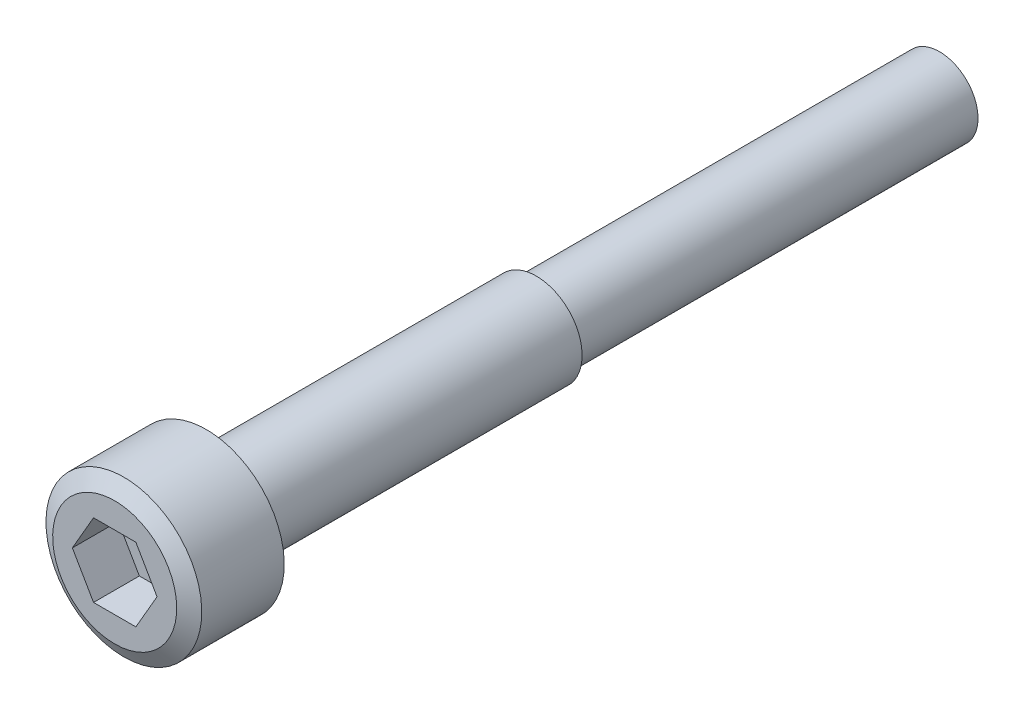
ISO-10303-21;
HEADER;
FILE_DESCRIPTION(('STEP AP214'),'2;1');
FILE_NAME('part.step','',(''),(''),'','','');
FILE_SCHEMA(('AUTOMOTIVE_DESIGN { 1 0 10303 214 1 1 1 1 }'));
ENDSEC;
DATA;
#1=APPLICATION_CONTEXT('core data for automotive mechanical design processes');
#2=APPLICATION_PROTOCOL_DEFINITION('international standard','automotive_design',2000,#1);
#3=PRODUCT_CONTEXT('',#1,'mechanical');
#4=PRODUCT('Part','Part','',(#3));
#5=PRODUCT_RELATED_PRODUCT_CATEGORY('part','',(#4));
#6=PRODUCT_DEFINITION_FORMATION('','',#4);
#7=PRODUCT_DEFINITION_CONTEXT('part definition',#1,'design');
#8=PRODUCT_DEFINITION('design','',#6,#7);
#9=PRODUCT_DEFINITION_SHAPE('','',#8);
#10=(LENGTH_UNIT() NAMED_UNIT(*) SI_UNIT(.MILLI.,.METRE.));
#11=(NAMED_UNIT(*) PLANE_ANGLE_UNIT() SI_UNIT($,.RADIAN.));
#12=(NAMED_UNIT(*) SI_UNIT($,.STERADIAN.) SOLID_ANGLE_UNIT());
#13=UNCERTAINTY_MEASURE_WITH_UNIT(LENGTH_MEASURE(1.E-05),#10,'distance_accuracy_value','');
#14=(GEOMETRIC_REPRESENTATION_CONTEXT(3) GLOBAL_UNCERTAINTY_ASSIGNED_CONTEXT((#13)) GLOBAL_UNIT_ASSIGNED_CONTEXT((#10,
#11,#12)) REPRESENTATION_CONTEXT('',''));
#15=CARTESIAN_POINT('',(0.,0.,0.));
#16=DIRECTION('',(0.,0.,1.));
#17=DIRECTION('',(1.,0.,0.));
#18=AXIS2_PLACEMENT_3D('',#15,#16,#17);
#19=CARTESIAN_POINT('',(0.,1.99999999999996,0.));
#20=DIRECTION('',(0.,0.,1.));
#21=DIRECTION('',(0.,-1.,0.));
#22=AXIS2_PLACEMENT_3D('',#19,#20,#21);
#23=PLANE('',#22);
#24=CARTESIAN_POINT('',(0.,0.,0.));
#25=DIRECTION('',(0.,0.,1.));
#26=DIRECTION('',(0.,-1.,0.));
#27=AXIS2_PLACEMENT_3D('',#24,#25,#26);
#28=CIRCLE('',#27,3.38397459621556);
#29=CARTESIAN_POINT('',(0.,-3.38397459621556,0.));
#30=VERTEX_POINT('',#29);
#31=EDGE_CURVE('E143',#30,#30,#28,.T.);
#32=ORIENTED_EDGE('',*,*,#31,.T.);
#33=EDGE_LOOP('',(#32));
#34=FACE_BOUND('',#33,.T.);
#35=DIRECTION('',(1.,0.,0.));
#36=VECTOR('',#35,1.);
#37=CARTESIAN_POINT('',(0.,-1.99999999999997,0.));
#38=LINE('',#37,#36);
#39=CARTESIAN_POINT('',(-1.15470053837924,-2.00000000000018,0.));
#40=VERTEX_POINT('',#39);
#41=CARTESIAN_POINT('',(1.15470053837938,-2.00000000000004,0.));
#42=VERTEX_POINT('',#41);
#43=EDGE_CURVE('E168',#40,#42,#38,.T.);
#44=ORIENTED_EDGE('',*,*,#43,.F.);
#45=DIRECTION('',(-0.499999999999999,0.866025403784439,0.));
#46=VECTOR('',#45,1.);
#47=CARTESIAN_POINT('',(-2.5980762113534,0.499999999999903,0.));
#48=LINE('',#47,#46);
#49=CARTESIAN_POINT('',(-2.30940107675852,0.,0.));
#50=VERTEX_POINT('',#49);
#51=EDGE_CURVE('E11',#40,#50,#48,.T.);
#52=ORIENTED_EDGE('',*,*,#51,.T.);
#53=DIRECTION('',(-0.499999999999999,-0.866025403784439,0.));
#54=VECTOR('',#53,1.);
#55=CARTESIAN_POINT('',(-0.866025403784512,2.49999999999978,0.));
#56=LINE('',#55,#54);
#57=CARTESIAN_POINT('',(-1.15470053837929,1.99999999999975,0.));
#58=VERTEX_POINT('',#57);
#59=EDGE_CURVE('E52',#58,#50,#56,.T.);
#60=ORIENTED_EDGE('',*,*,#59,.F.);
#61=DIRECTION('',(1.,0.,0.));
#62=VECTOR('',#61,1.);
#63=CARTESIAN_POINT('',(0.,1.99999999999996,0.));
#64=LINE('',#63,#62);
#65=CARTESIAN_POINT('',(1.15470053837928,1.99999999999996,0.));
#66=VERTEX_POINT('',#65);
#67=EDGE_CURVE('E108',#58,#66,#64,.T.);
#68=ORIENTED_EDGE('',*,*,#67,.T.);
#69=DIRECTION('',(0.499999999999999,-0.866025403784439,0.));
#70=VECTOR('',#69,1.);
#71=CARTESIAN_POINT('',(0.866025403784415,2.49999999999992,0.));
#72=LINE('',#71,#70);
#73=CARTESIAN_POINT('',(2.30940107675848,-1.52655665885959E-13,0.));
#74=VERTEX_POINT('',#73);
#75=EDGE_CURVE('E163',#66,#74,#72,.T.);
#76=ORIENTED_EDGE('',*,*,#75,.T.);
#77=DIRECTION('',(0.499999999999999,0.866025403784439,0.));
#78=VECTOR('',#77,1.);
#79=CARTESIAN_POINT('',(2.59807621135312,0.499999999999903,0.));
#80=LINE('',#79,#78);
#81=EDGE_CURVE('E159',#42,#74,#80,.T.);
#82=ORIENTED_EDGE('',*,*,#81,.F.);
#83=EDGE_LOOP('',(#44,#52,#60,#68,#76,#82));
#84=FACE_BOUND('',#83,.T.);
#85=ADVANCED_FACE('F42',(#34,#84),#23,.T.);
#86=CARTESIAN_POINT('',(0.,0.,0.));
#87=DIRECTION('',(0.,0.,1.));
#88=DIRECTION('',(0.,-1.,0.));
#89=AXIS2_PLACEMENT_3D('',#86,#87,#88);
#90=CYLINDRICAL_SURFACE('',#89,2.5);
#91=CARTESIAN_POINT('',(0.,0.,-23.));
#92=DIRECTION('',(0.,0.,1.));
#93=DIRECTION('',(0.,-1.,0.));
#94=AXIS2_PLACEMENT_3D('',#91,#92,#93);
#95=CIRCLE('',#94,2.5);
#96=CARTESIAN_POINT('',(0.,-2.5,-23.));
#97=VERTEX_POINT('',#96);
#98=EDGE_CURVE('E155',#97,#97,#95,.T.);
#99=ORIENTED_EDGE('',*,*,#98,.T.);
#100=EDGE_LOOP('',(#99));
#101=FACE_BOUND('',#100,.T.);
#102=CARTESIAN_POINT('',(0.,0.,-5.));
#103=DIRECTION('',(0.,0.,1.));
#104=DIRECTION('',(0.,-1.,0.));
#105=AXIS2_PLACEMENT_3D('',#102,#103,#104);
#106=CIRCLE('',#105,2.5);
#107=CARTESIAN_POINT('',(0.,-2.50000000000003,-5.));
#108=VERTEX_POINT('',#107);
#109=EDGE_CURVE('E131',#108,#108,#106,.T.);
#110=ORIENTED_EDGE('',*,*,#109,.F.);
#111=EDGE_LOOP('',(#110));
#112=FACE_BOUND('',#111,.T.);
#113=ADVANCED_FACE('F44',(#101,#112),#90,.T.);
#114=CARTESIAN_POINT('',(0.,2.49999999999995,-23.));
#115=DIRECTION('',(0.,0.,-1.));
#116=DIRECTION('',(0.,1.,0.));
#117=AXIS2_PLACEMENT_3D('',#114,#115,#116);
#118=PLANE('',#117);
#119=CARTESIAN_POINT('',(0.,0.,-23.));
#120=DIRECTION('',(0.,0.,1.));
#121=DIRECTION('',(0.,-1.,0.));
#122=AXIS2_PLACEMENT_3D('',#119,#120,#121);
#123=CIRCLE('',#122,2.1);
#124=CARTESIAN_POINT('',(0.,-2.1,-23.));
#125=VERTEX_POINT('',#124);
#126=EDGE_CURVE('E151',#125,#125,#123,.T.);
#127=ORIENTED_EDGE('',*,*,#126,.T.);
#128=EDGE_LOOP('',(#127));
#129=FACE_BOUND('',#128,.T.);
#130=ORIENTED_EDGE('',*,*,#98,.F.);
#131=EDGE_LOOP('',(#130));
#132=FACE_BOUND('',#131,.T.);
#133=ADVANCED_FACE('F227',(#129,#132),#118,.T.);
#134=CARTESIAN_POINT('',(0.,0.,0.));
#135=DIRECTION('',(0.,0.,1.));
#136=DIRECTION('',(0.,-1.,0.));
#137=AXIS2_PLACEMENT_3D('',#134,#135,#136);
#138=CYLINDRICAL_SURFACE('',#137,2.1);
#139=CARTESIAN_POINT('',(0.,0.,-44.9999999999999));
#140=DIRECTION('',(0.,0.,1.));
#141=DIRECTION('',(0.,-1.,0.));
#142=AXIS2_PLACEMENT_3D('',#139,#140,#141);
#143=CIRCLE('',#142,2.09999999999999);
#144=CARTESIAN_POINT('',(0.,-2.10000000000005,-44.9999999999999));
#145=VERTEX_POINT('',#144);
#146=EDGE_CURVE('E147',#145,#145,#143,.T.);
#147=ORIENTED_EDGE('',*,*,#146,.T.);
#148=EDGE_LOOP('',(#147));
#149=FACE_BOUND('',#148,.T.);
#150=ORIENTED_EDGE('',*,*,#126,.F.);
#151=EDGE_LOOP('',(#150));
#152=FACE_BOUND('',#151,.T.);
#153=ADVANCED_FACE('F238',(#149,#152),#138,.T.);
#154=CARTESIAN_POINT('',(0.,2.09999999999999,-44.9999999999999));
#155=DIRECTION('',(0.,0.,-1.));
#156=DIRECTION('',(0.,1.,0.));
#157=AXIS2_PLACEMENT_3D('',#154,#155,#156);
#158=PLANE('',#157);
#159=ORIENTED_EDGE('',*,*,#146,.F.);
#160=EDGE_LOOP('',(#159));
#161=FACE_BOUND('',#160,.T.);
#162=ADVANCED_FACE('F235',(#161),#158,.T.);
#163=CARTESIAN_POINT('',(0.,0.,0.));
#164=DIRECTION('',(0.,0.,-1.));
#165=DIRECTION('',(0.,1.,0.));
#166=AXIS2_PLACEMENT_3D('',#163,#164,#165);
#167=CONICAL_SURFACE('',#166,3.38397459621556,1.0471975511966);
#168=CARTESIAN_POINT('',(0.,0.,-0.5));
#169=DIRECTION('',(0.,0.,1.));
#170=DIRECTION('',(0.,-1.,0.));
#171=AXIS2_PLACEMENT_3D('',#168,#169,#170);
#172=CIRCLE('',#171,4.25);
#173=CARTESIAN_POINT('',(0.,-4.25,-0.500000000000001));
#174=VERTEX_POINT('',#173);
#175=EDGE_CURVE('E139',#174,#174,#172,.T.);
#176=ORIENTED_EDGE('',*,*,#175,.T.);
#177=EDGE_LOOP('',(#176));
#178=FACE_BOUND('',#177,.T.);
#179=ORIENTED_EDGE('',*,*,#31,.F.);
#180=EDGE_LOOP('',(#179));
#181=FACE_BOUND('',#180,.T.);
#182=ADVANCED_FACE('F231',(#178,#181),#167,.T.);
#183=CARTESIAN_POINT('',(0.,0.,0.));
#184=DIRECTION('',(0.,0.,1.));
#185=DIRECTION('',(0.,-1.,0.));
#186=AXIS2_PLACEMENT_3D('',#183,#184,#185);
#187=CYLINDRICAL_SURFACE('',#186,4.25);
#188=CARTESIAN_POINT('',(0.,0.,-5.));
#189=DIRECTION('',(0.,0.,1.));
#190=DIRECTION('',(0.,-1.,0.));
#191=AXIS2_PLACEMENT_3D('',#188,#189,#190);
#192=CIRCLE('',#191,4.25);
#193=CARTESIAN_POINT('',(0.,-4.25000000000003,-5.00000000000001));
#194=VERTEX_POINT('',#193);
#195=EDGE_CURVE('E135',#194,#194,#192,.T.);
#196=ORIENTED_EDGE('',*,*,#195,.T.);
#197=EDGE_LOOP('',(#196));
#198=FACE_BOUND('',#197,.T.);
#199=ORIENTED_EDGE('',*,*,#175,.F.);
#200=EDGE_LOOP('',(#199));
#201=FACE_BOUND('',#200,.T.);
#202=ADVANCED_FACE('F254',(#198,#201),#187,.T.);
#203=CARTESIAN_POINT('',(0.,2.84999999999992,-5.));
#204=DIRECTION('',(0.,0.,-1.));
#205=DIRECTION('',(0.,1.,0.));
#206=AXIS2_PLACEMENT_3D('',#203,#204,#205);
#207=PLANE('',#206);
#208=ORIENTED_EDGE('',*,*,#109,.T.);
#209=EDGE_LOOP('',(#208));
#210=FACE_BOUND('',#209,.T.);
#211=ORIENTED_EDGE('',*,*,#195,.F.);
#212=EDGE_LOOP('',(#211));
#213=FACE_BOUND('',#212,.T.);
#214=ADVANCED_FACE('F219',(#210,#213),#207,.T.);
#215=CARTESIAN_POINT('',(-1.15470053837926,-2.00000000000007,-8.61010092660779));
#216=DIRECTION('',(0.,-1.,0.));
#217=DIRECTION('',(0.,0.,-1.));
#218=AXIS2_PLACEMENT_3D('',#215,#216,#217);
#219=PLANE('',#218);
#220=ORIENTED_EDGE('',*,*,#43,.T.);
#221=DIRECTION('',(0.,0.,1.));
#222=VECTOR('',#221,1.);
#223=CARTESIAN_POINT('',(1.1547005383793,-2.00000000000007,-8.61010092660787));
#224=LINE('',#223,#222);
#225=CARTESIAN_POINT('',(1.15470053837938,-2.00000000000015,-2.50000000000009));
#226=VERTEX_POINT('',#225);
#227=EDGE_CURVE('E124',#226,#42,#224,.T.);
#228=ORIENTED_EDGE('',*,*,#227,.F.);
#229=DIRECTION('',(-1.,0.,0.));
#230=VECTOR('',#229,1.);
#231=CARTESIAN_POINT('',(-1.15470053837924,-2.00000000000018,-2.5));
#232=LINE('',#231,#230);
#233=CARTESIAN_POINT('',(-1.15470053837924,-2.00000000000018,-2.5));
#234=VERTEX_POINT('',#233);
#235=EDGE_CURVE('E62',#226,#234,#232,.T.);
#236=ORIENTED_EDGE('',*,*,#235,.T.);
#237=DIRECTION('',(0.,0.,1.));
#238=VECTOR('',#237,1.);
#239=CARTESIAN_POINT('',(-1.15470053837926,-2.00000000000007,-8.61010092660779));
#240=LINE('',#239,#238);
#241=EDGE_CURVE('E114',#234,#40,#240,.T.);
#242=ORIENTED_EDGE('',*,*,#241,.T.);
#243=EDGE_LOOP('',(#220,#228,#236,#242));
#244=FACE_BOUND('',#243,.T.);
#245=ADVANCED_FACE('F177',(#244),#219,.F.);
#246=CARTESIAN_POINT('',(-1.15470053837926,-2.00000000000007,-8.61010092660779));
#247=DIRECTION('',(0.866025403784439,0.499999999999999,0.));
#248=DIRECTION('',(-0.499999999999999,0.866025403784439,0.));
#249=AXIS2_PLACEMENT_3D('',#246,#247,#248);
#250=PLANE('',#249);
#251=ORIENTED_EDGE('',*,*,#51,.F.);
#252=ORIENTED_EDGE('',*,*,#241,.F.);
#253=DIRECTION('',(0.499999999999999,-0.866025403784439,0.));
#254=VECTOR('',#253,1.);
#255=CARTESIAN_POINT('',(-1.15470053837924,-2.00000000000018,-2.5));
#256=LINE('',#255,#254);
#257=CARTESIAN_POINT('',(-2.30940107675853,0.,-2.5));
#258=VERTEX_POINT('',#257);
#259=EDGE_CURVE('E93',#258,#234,#256,.T.);
#260=ORIENTED_EDGE('',*,*,#259,.F.);
#261=DIRECTION('',(0.,0.,1.));
#262=VECTOR('',#261,1.);
#263=CARTESIAN_POINT('',(-2.30940107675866,0.,-8.61010092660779));
#264=LINE('',#263,#262);
#265=EDGE_CURVE('E91',#258,#50,#264,.T.);
#266=ORIENTED_EDGE('',*,*,#265,.T.);
#267=EDGE_LOOP('',(#251,#252,#260,#266));
#268=FACE_BOUND('',#267,.T.);
#269=ADVANCED_FACE('F204',(#268),#250,.T.);
#270=CARTESIAN_POINT('',(-1.15470053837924,1.99999999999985,-8.61010092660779));
#271=DIRECTION('',(-0.866025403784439,0.499999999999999,0.));
#272=DIRECTION('',(-0.499999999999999,-0.866025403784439,0.));
#273=AXIS2_PLACEMENT_3D('',#270,#271,#272);
#274=PLANE('',#273);
#275=ORIENTED_EDGE('',*,*,#59,.T.);
#276=ORIENTED_EDGE('',*,*,#265,.F.);
#277=DIRECTION('',(0.499999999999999,0.866025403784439,0.));
#278=VECTOR('',#277,1.);
#279=CARTESIAN_POINT('',(-1.15470053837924,1.99999999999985,-2.5));
#280=LINE('',#279,#278);
#281=CARTESIAN_POINT('',(-1.15470053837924,1.99999999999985,-2.5));
#282=VERTEX_POINT('',#281);
#283=EDGE_CURVE('E83',#258,#282,#280,.T.);
#284=ORIENTED_EDGE('',*,*,#283,.T.);
#285=DIRECTION('',(0.,0.,1.));
#286=VECTOR('',#285,1.);
#287=CARTESIAN_POINT('',(-1.15470053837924,1.99999999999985,-8.61010092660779));
#288=LINE('',#287,#286);
#289=EDGE_CURVE('E89',#282,#58,#288,.T.);
#290=ORIENTED_EDGE('',*,*,#289,.T.);
#291=EDGE_LOOP('',(#275,#276,#284,#290));
#292=FACE_BOUND('',#291,.T.);
#293=ADVANCED_FACE('F86',(#292),#274,.F.);
#294=CARTESIAN_POINT('',(-1.15470053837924,1.99999999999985,-8.61010092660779));
#295=DIRECTION('',(0.,-1.,0.));
#296=DIRECTION('',(0.,0.,-1.));
#297=AXIS2_PLACEMENT_3D('',#294,#295,#296);
#298=PLANE('',#297);
#299=ORIENTED_EDGE('',*,*,#67,.F.);
#300=ORIENTED_EDGE('',*,*,#289,.F.);
#301=DIRECTION('',(-1.,0.,0.));
#302=VECTOR('',#301,1.);
#303=CARTESIAN_POINT('',(-1.15470053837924,1.99999999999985,-2.5));
#304=LINE('',#303,#302);
#305=CARTESIAN_POINT('',(1.15470053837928,1.99999999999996,-2.5));
#306=VERTEX_POINT('',#305);
#307=EDGE_CURVE('E94',#306,#282,#304,.T.);
#308=ORIENTED_EDGE('',*,*,#307,.F.);
#309=DIRECTION('',(0.,0.,1.));
#310=VECTOR('',#309,1.);
#311=CARTESIAN_POINT('',(1.15470053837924,1.9999999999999,-8.61010092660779));
#312=LINE('',#311,#310);
#313=EDGE_CURVE('E110',#306,#66,#312,.T.);
#314=ORIENTED_EDGE('',*,*,#313,.T.);
#315=EDGE_LOOP('',(#299,#300,#308,#314));
#316=FACE_BOUND('',#315,.T.);
#317=ADVANCED_FACE('F106',(#316),#298,.T.);
#318=CARTESIAN_POINT('',(1.15470053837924,1.9999999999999,-8.61010092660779));
#319=DIRECTION('',(-0.866025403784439,-0.499999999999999,0.));
#320=DIRECTION('',(0.499999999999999,-0.866025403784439,0.));
#321=AXIS2_PLACEMENT_3D('',#318,#319,#320);
#322=PLANE('',#321);
#323=ORIENTED_EDGE('',*,*,#75,.F.);
#324=ORIENTED_EDGE('',*,*,#313,.F.);
#325=DIRECTION('',(-0.499999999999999,0.866025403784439,0.));
#326=VECTOR('',#325,1.);
#327=CARTESIAN_POINT('',(1.15470053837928,1.99999999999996,-2.5));
#328=LINE('',#327,#326);
#329=CARTESIAN_POINT('',(2.30940107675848,-2.22044604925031E-13,-2.50000000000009));
#330=VERTEX_POINT('',#329);
#331=EDGE_CURVE('E99',#330,#306,#328,.T.);
#332=ORIENTED_EDGE('',*,*,#331,.F.);
#333=DIRECTION('',(0.,0.,1.));
#334=VECTOR('',#333,1.);
#335=CARTESIAN_POINT('',(2.3094010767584,-1.66533453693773E-13,-8.61010092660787));
#336=LINE('',#335,#334);
#337=EDGE_CURVE('E117',#330,#74,#336,.T.);
#338=ORIENTED_EDGE('',*,*,#337,.T.);
#339=EDGE_LOOP('',(#323,#324,#332,#338));
#340=FACE_BOUND('',#339,.T.);
#341=ADVANCED_FACE('F202',(#340),#322,.T.);
#342=CARTESIAN_POINT('',(1.1547005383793,-2.00000000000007,-8.61010092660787));
#343=DIRECTION('',(0.866025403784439,-0.499999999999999,0.));
#344=DIRECTION('',(0.499999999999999,0.866025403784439,0.));
#345=AXIS2_PLACEMENT_3D('',#342,#343,#344);
#346=PLANE('',#345);
#347=ORIENTED_EDGE('',*,*,#81,.T.);
#348=ORIENTED_EDGE('',*,*,#337,.F.);
#349=DIRECTION('',(-0.499999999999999,-0.866025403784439,0.));
#350=VECTOR('',#349,1.);
#351=CARTESIAN_POINT('',(1.15470053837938,-2.00000000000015,-2.50000000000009));
#352=LINE('',#351,#350);
#353=EDGE_CURVE('E128',#330,#226,#352,.T.);
#354=ORIENTED_EDGE('',*,*,#353,.T.);
#355=ORIENTED_EDGE('',*,*,#227,.T.);
#356=EDGE_LOOP('',(#347,#348,#354,#355));
#357=FACE_BOUND('',#356,.T.);
#358=ADVANCED_FACE('F187',(#357),#346,.F.);
#359=CARTESIAN_POINT('',(0.,1.99999999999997,-2.5));
#360=DIRECTION('',(0.,0.,-1.));
#361=DIRECTION('',(0.,1.,0.));
#362=AXIS2_PLACEMENT_3D('',#359,#360,#361);
#363=PLANE('',#362);
#364=ORIENTED_EDGE('',*,*,#259,.T.);
#365=ORIENTED_EDGE('',*,*,#235,.F.);
#366=ORIENTED_EDGE('',*,*,#353,.F.);
#367=ORIENTED_EDGE('',*,*,#331,.T.);
#368=ORIENTED_EDGE('',*,*,#307,.T.);
#369=ORIENTED_EDGE('',*,*,#283,.F.);
#370=EDGE_LOOP('',(#364,#365,#366,#367,#368,#369));
#371=FACE_BOUND('',#370,.T.);
#372=ADVANCED_FACE('F97',(#371),#363,.F.);
#373=CLOSED_SHELL('',(#85,#113,#133,#153,#162,#182,#202,#214,#245,#269,#293,#317,#341,#358,#372));
#374=MANIFOLD_SOLID_BREP('B2',#373);
#375=ADVANCED_BREP_SHAPE_REPRESENTATION('',(#18,#374),#14);
#376=SHAPE_DEFINITION_REPRESENTATION(#9,#375);
ENDSEC;
END-ISO-10303-21;
